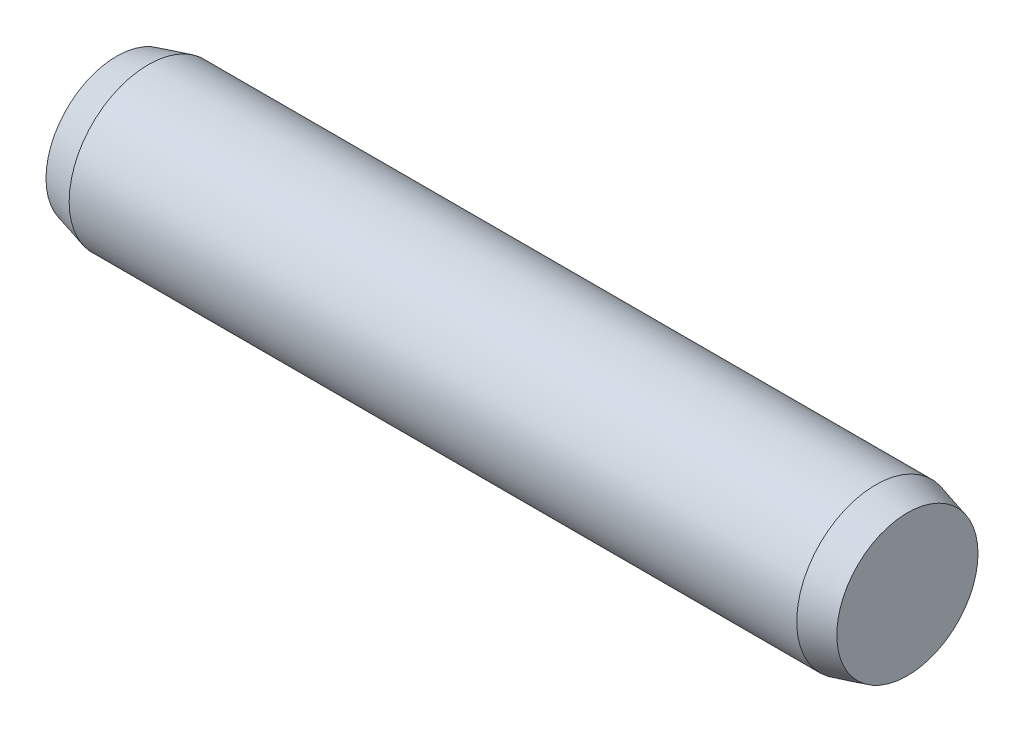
ISO-10303-21;
HEADER;
FILE_DESCRIPTION(('STEP AP214'),'2;1');
FILE_NAME('part.step','',(''),(''),'','','');
FILE_SCHEMA(('AUTOMOTIVE_DESIGN { 1 0 10303 214 1 1 1 1 }'));
ENDSEC;
DATA;
#1=APPLICATION_CONTEXT('core data for automotive mechanical design processes');
#2=APPLICATION_PROTOCOL_DEFINITION('international standard','automotive_design',2000,#1);
#3=PRODUCT_CONTEXT('',#1,'mechanical');
#4=PRODUCT('Part','Part','',(#3));
#5=PRODUCT_RELATED_PRODUCT_CATEGORY('part','',(#4));
#6=PRODUCT_DEFINITION_FORMATION('','',#4);
#7=PRODUCT_DEFINITION_CONTEXT('part definition',#1,'design');
#8=PRODUCT_DEFINITION('design','',#6,#7);
#9=PRODUCT_DEFINITION_SHAPE('','',#8);
#10=(LENGTH_UNIT() NAMED_UNIT(*) SI_UNIT(.MILLI.,.METRE.));
#11=(NAMED_UNIT(*) PLANE_ANGLE_UNIT() SI_UNIT($,.RADIAN.));
#12=(NAMED_UNIT(*) SI_UNIT($,.STERADIAN.) SOLID_ANGLE_UNIT());
#13=UNCERTAINTY_MEASURE_WITH_UNIT(LENGTH_MEASURE(1.E-05),#10,'distance_accuracy_value','');
#14=(GEOMETRIC_REPRESENTATION_CONTEXT(3) GLOBAL_UNCERTAINTY_ASSIGNED_CONTEXT((#13)) GLOBAL_UNIT_ASSIGNED_CONTEXT((#10,
#11,#12)) REPRESENTATION_CONTEXT('',''));
#15=CARTESIAN_POINT('',(0.,0.,0.));
#16=DIRECTION('',(0.,0.,1.));
#17=DIRECTION('',(1.,0.,0.));
#18=AXIS2_PLACEMENT_3D('',#15,#16,#17);
#19=CARTESIAN_POINT('',(0.,0.,0.));
#20=DIRECTION('',(-1.,0.,0.));
#21=DIRECTION('',(0.,0.,1.));
#22=AXIS2_PLACEMENT_3D('',#19,#20,#21);
#23=PLANE('',#22);
#24=CARTESIAN_POINT('',(0.,0.,0.));
#25=DIRECTION('',(-1.,0.,0.));
#26=DIRECTION('',(0.,0.,1.));
#27=AXIS2_PLACEMENT_3D('',#24,#25,#26);
#28=CIRCLE('',#27,3.5712812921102);
#29=CARTESIAN_POINT('',(0.,0.,3.5712812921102));
#30=VERTEX_POINT('',#29);
#31=EDGE_CURVE('E8',#30,#30,#28,.T.);
#32=ORIENTED_EDGE('',*,*,#31,.T.);
#33=EDGE_LOOP('',(#32));
#34=FACE_BOUND('',#33,.T.);
#35=ADVANCED_FACE('F12',(#34),#23,.T.);
#36=CARTESIAN_POINT('',(0.,0.,0.));
#37=DIRECTION('',(1.,0.,0.));
#38=DIRECTION('',(0.,0.,-1.));
#39=AXIS2_PLACEMENT_3D('',#36,#37,#38);
#40=CYLINDRICAL_SURFACE('',#39,4.);
#41=CARTESIAN_POINT('',(1.6,0.,0.));
#42=DIRECTION('',(-1.,0.,0.));
#43=DIRECTION('',(0.,0.,1.));
#44=AXIS2_PLACEMENT_3D('',#41,#42,#43);
#45=CIRCLE('',#44,4.);
#46=CARTESIAN_POINT('',(1.6,0.,4.));
#47=VERTEX_POINT('',#46);
#48=EDGE_CURVE('E19',#47,#47,#45,.F.);
#49=ORIENTED_EDGE('',*,*,#48,.T.);
#50=EDGE_LOOP('',(#49));
#51=FACE_BOUND('',#50,.T.);
#52=CARTESIAN_POINT('',(38.4,0.,0.));
#53=DIRECTION('',(1.,0.,0.));
#54=DIRECTION('',(0.,0.,-1.));
#55=AXIS2_PLACEMENT_3D('',#52,#53,#54);
#56=CIRCLE('',#55,4.);
#57=CARTESIAN_POINT('',(38.4,0.,-4.));
#58=VERTEX_POINT('',#57);
#59=EDGE_CURVE('E23',#58,#58,#56,.F.);
#60=ORIENTED_EDGE('',*,*,#59,.T.);
#61=EDGE_LOOP('',(#60));
#62=FACE_BOUND('',#61,.T.);
#63=ADVANCED_FACE('F44',(#51,#62),#40,.T.);
#64=CARTESIAN_POINT('',(40.,0.,0.));
#65=DIRECTION('',(1.,0.,0.));
#66=DIRECTION('',(0.,0.,-1.));
#67=AXIS2_PLACEMENT_3D('',#64,#65,#66);
#68=PLANE('',#67);
#69=CARTESIAN_POINT('',(40.,0.,0.));
#70=DIRECTION('',(1.,0.,0.));
#71=DIRECTION('',(0.,0.,-1.));
#72=AXIS2_PLACEMENT_3D('',#69,#70,#71);
#73=CIRCLE('',#72,3.5712812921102);
#74=CARTESIAN_POINT('',(40.,0.,-3.5712812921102));
#75=VERTEX_POINT('',#74);
#76=EDGE_CURVE('E27',#75,#75,#73,.T.);
#77=ORIENTED_EDGE('',*,*,#76,.T.);
#78=EDGE_LOOP('',(#77));
#79=FACE_BOUND('',#78,.T.);
#80=ADVANCED_FACE('F33',(#79),#68,.T.);
#81=CARTESIAN_POINT('',(40.,0.,0.));
#82=DIRECTION('',(-1.,0.,0.));
#83=DIRECTION('',(0.,0.,1.));
#84=AXIS2_PLACEMENT_3D('',#81,#82,#83);
#85=CONICAL_SURFACE('',#84,3.5712812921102,0.261799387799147);
#86=ORIENTED_EDGE('',*,*,#59,.F.);
#87=EDGE_LOOP('',(#86));
#88=FACE_BOUND('',#87,.T.);
#89=ORIENTED_EDGE('',*,*,#76,.F.);
#90=EDGE_LOOP('',(#89));
#91=FACE_BOUND('',#90,.T.);
#92=ADVANCED_FACE('F35',(#88,#91),#85,.T.);
#93=CARTESIAN_POINT('',(1.6,0.,0.));
#94=DIRECTION('',(1.,0.,0.));
#95=DIRECTION('',(0.,0.,-1.));
#96=AXIS2_PLACEMENT_3D('',#93,#94,#95);
#97=CONICAL_SURFACE('',#96,4.,0.261799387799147);
#98=ORIENTED_EDGE('',*,*,#31,.F.);
#99=EDGE_LOOP('',(#98));
#100=FACE_BOUND('',#99,.T.);
#101=ORIENTED_EDGE('',*,*,#48,.F.);
#102=EDGE_LOOP('',(#101));
#103=FACE_BOUND('',#102,.T.);
#104=ADVANCED_FACE('F14',(#100,#103),#97,.T.);
#105=CLOSED_SHELL('',(#35,#63,#80,#92,#104));
#106=MANIFOLD_SOLID_BREP('B1',#105);
#107=ADVANCED_BREP_SHAPE_REPRESENTATION('',(#18,#106),#14);
#108=SHAPE_DEFINITION_REPRESENTATION(#9,#107);
ENDSEC;
END-ISO-10303-21;
